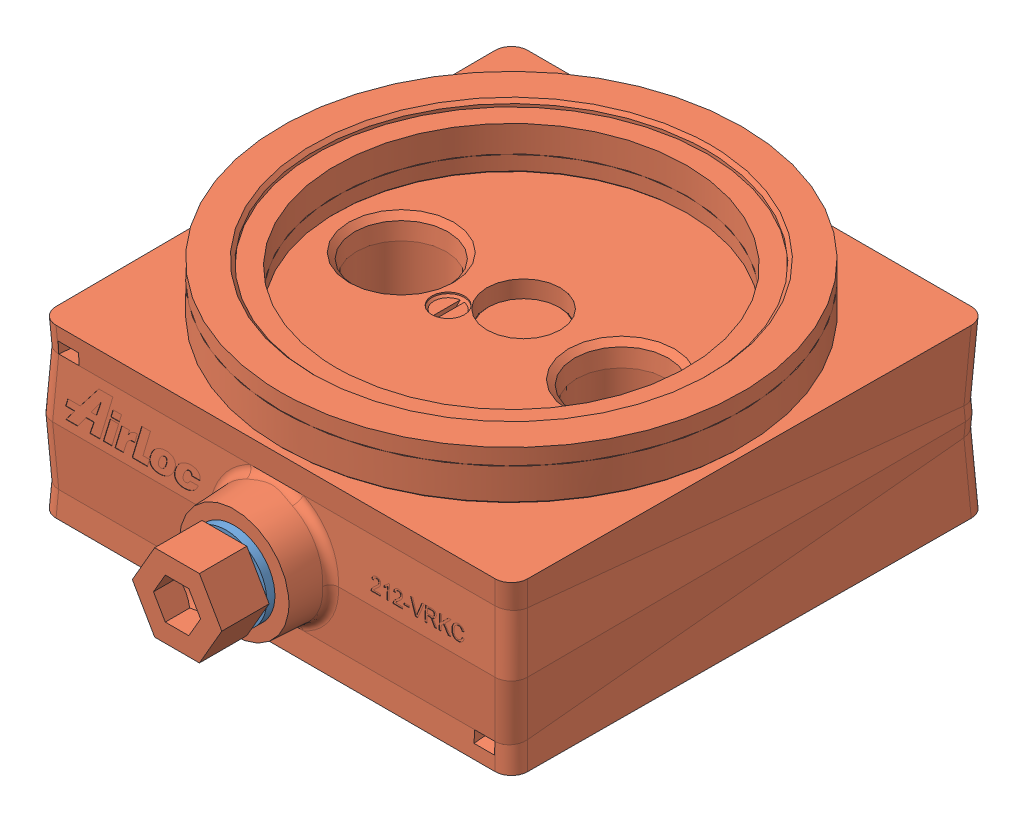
SolidWorks assembly Boiler End Trolley - AirLoc Wedge Mount 212-VRKC-903.sldasm, configuration Default (file format 6000). Lengths in mm.
Overall size (116.81 54.98 140.41).
2 component instances, 2 part files, 0 mates.
Components (placement in the parent):
- 212-VRKC-2-1: 212-VRKC-2.sldprt [Default] at origin size (20 20 2)
- 212-VRKC-2_1-1: 212-VRKC-2_1.sldprt [Default] at origin size (116.81 54.98 140.41)
